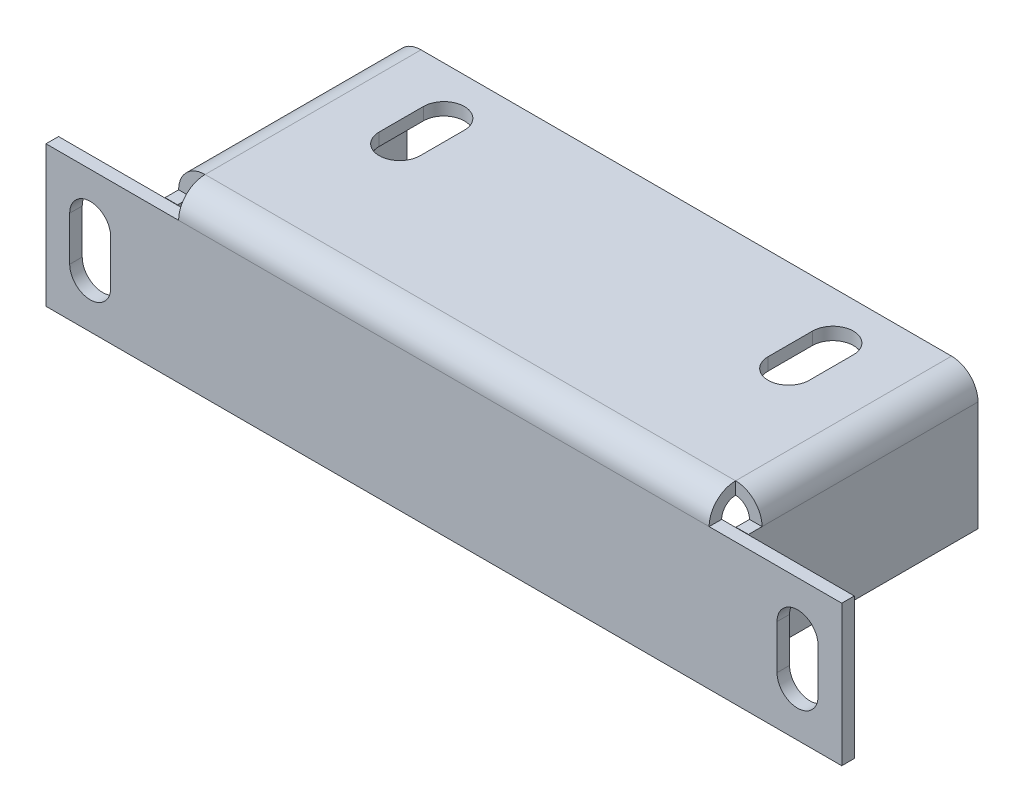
ISO-10303-21;
HEADER;
FILE_DESCRIPTION(('STEP AP214'),'2;1');
FILE_NAME('part.step','',(''),(''),'','','');
FILE_SCHEMA(('AUTOMOTIVE_DESIGN { 1 0 10303 214 1 1 1 1 }'));
ENDSEC;
DATA;
#1=APPLICATION_CONTEXT('core data for automotive mechanical design processes');
#2=APPLICATION_PROTOCOL_DEFINITION('international standard','automotive_design',2000,#1);
#3=PRODUCT_CONTEXT('',#1,'mechanical');
#4=PRODUCT('Part','Part','',(#3));
#5=PRODUCT_RELATED_PRODUCT_CATEGORY('part','',(#4));
#6=PRODUCT_DEFINITION_FORMATION('','',#4);
#7=PRODUCT_DEFINITION_CONTEXT('part definition',#1,'design');
#8=PRODUCT_DEFINITION('design','',#6,#7);
#9=PRODUCT_DEFINITION_SHAPE('','',#8);
#10=(LENGTH_UNIT() NAMED_UNIT(*) SI_UNIT(.MILLI.,.METRE.));
#11=(NAMED_UNIT(*) PLANE_ANGLE_UNIT() SI_UNIT($,.RADIAN.));
#12=(NAMED_UNIT(*) SI_UNIT($,.STERADIAN.) SOLID_ANGLE_UNIT());
#13=UNCERTAINTY_MEASURE_WITH_UNIT(LENGTH_MEASURE(1.E-05),#10,'distance_accuracy_value','');
#14=(GEOMETRIC_REPRESENTATION_CONTEXT(3) GLOBAL_UNCERTAINTY_ASSIGNED_CONTEXT((#13)) GLOBAL_UNIT_ASSIGNED_CONTEXT((#10,
#11,#12)) REPRESENTATION_CONTEXT('',''));
#15=CARTESIAN_POINT('',(0.,0.,0.));
#16=DIRECTION('',(0.,0.,1.));
#17=DIRECTION('',(1.,0.,0.));
#18=AXIS2_PLACEMENT_3D('',#15,#16,#17);
#19=CARTESIAN_POINT('',(0.,0.899999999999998,0.));
#20=DIRECTION('',(0.,-1.,0.));
#21=DIRECTION('',(0.,0.,-1.));
#22=AXIS2_PLACEMENT_3D('',#19,#20,#21);
#23=PLANE('',#22);
#24=DIRECTION('',(0.,0.,-1.));
#25=VECTOR('',#24,1.);
#26=CARTESIAN_POINT('',(31.5468,0.900000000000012,-13.07));
#27=LINE('',#26,#25);
#28=CARTESIAN_POINT('',(31.5468,0.900000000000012,-9.89499999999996));
#29=VERTEX_POINT('',#28);
#30=CARTESIAN_POINT('',(31.5468,0.900000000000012,-13.07));
#31=VERTEX_POINT('',#30);
#32=EDGE_CURVE('E524',#29,#31,#27,.T.);
#33=ORIENTED_EDGE('',*,*,#32,.T.);
#34=CARTESIAN_POINT('',(33.02,0.900000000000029,-13.07));
#35=DIRECTION('',(0.,-1.,0.));
#36=DIRECTION('',(0.,0.,1.));
#37=AXIS2_PLACEMENT_3D('',#34,#35,#36);
#38=CIRCLE('',#37,1.4732);
#39=CARTESIAN_POINT('',(34.4932,0.900000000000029,-13.07));
#40=VERTEX_POINT('',#39);
#41=EDGE_CURVE('E514',#31,#40,#38,.T.);
#42=ORIENTED_EDGE('',*,*,#41,.T.);
#43=DIRECTION('',(0.,0.,1.));
#44=VECTOR('',#43,1.);
#45=CARTESIAN_POINT('',(34.4932,0.900000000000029,-9.89499999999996));
#46=LINE('',#45,#44);
#47=CARTESIAN_POINT('',(34.4932,0.900000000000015,-9.89499999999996));
#48=VERTEX_POINT('',#47);
#49=EDGE_CURVE('E517',#40,#48,#46,.T.);
#50=ORIENTED_EDGE('',*,*,#49,.T.);
#51=CARTESIAN_POINT('',(33.02,0.900000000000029,-9.89499999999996));
#52=DIRECTION('',(0.,-1.,0.));
#53=DIRECTION('',(0.,0.,1.));
#54=AXIS2_PLACEMENT_3D('',#51,#52,#53);
#55=CIRCLE('',#54,1.4732);
#56=EDGE_CURVE('E521',#48,#29,#55,.T.);
#57=ORIENTED_EDGE('',*,*,#56,.T.);
#58=EDGE_LOOP('',(#33,#42,#50,#57));
#59=FACE_BOUND('',#58,.T.);
#60=DIRECTION('',(0.,0.,1.));
#61=VECTOR('',#60,1.);
#62=CARTESIAN_POINT('',(6.5532,0.900000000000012,-13.07));
#63=LINE('',#62,#61);
#64=CARTESIAN_POINT('',(6.5532,0.900000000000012,-13.07));
#65=VERTEX_POINT('',#64);
#66=CARTESIAN_POINT('',(6.5532,0.900000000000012,-9.89499999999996));
#67=VERTEX_POINT('',#66);
#68=EDGE_CURVE('E556',#65,#67,#63,.T.);
#69=ORIENTED_EDGE('',*,*,#68,.T.);
#70=CARTESIAN_POINT('',(5.08,0.900000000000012,-9.89499999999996));
#71=DIRECTION('',(0.,-1.,0.));
#72=DIRECTION('',(0.,0.,-1.));
#73=AXIS2_PLACEMENT_3D('',#70,#71,#72);
#74=CIRCLE('',#73,1.4732);
#75=CARTESIAN_POINT('',(3.6068,0.900000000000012,-9.89499999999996));
#76=VERTEX_POINT('',#75);
#77=EDGE_CURVE('E546',#67,#76,#74,.T.);
#78=ORIENTED_EDGE('',*,*,#77,.T.);
#79=DIRECTION('',(0.,0.,-1.));
#80=VECTOR('',#79,1.);
#81=CARTESIAN_POINT('',(3.6068,0.900000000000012,-9.89499999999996));
#82=LINE('',#81,#80);
#83=CARTESIAN_POINT('',(3.60680000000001,0.899999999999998,-13.07));
#84=VERTEX_POINT('',#83);
#85=EDGE_CURVE('E549',#76,#84,#82,.T.);
#86=ORIENTED_EDGE('',*,*,#85,.T.);
#87=CARTESIAN_POINT('',(5.08,0.900000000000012,-13.07));
#88=DIRECTION('',(0.,-1.,0.));
#89=DIRECTION('',(0.,0.,-1.));
#90=AXIS2_PLACEMENT_3D('',#87,#88,#89);
#91=CIRCLE('',#90,1.4732);
#92=EDGE_CURVE('E553',#84,#65,#91,.T.);
#93=ORIENTED_EDGE('',*,*,#92,.T.);
#94=EDGE_LOOP('',(#69,#78,#86,#93));
#95=FACE_BOUND('',#94,.T.);
#96=DIRECTION('',(-1.,0.,0.));
#97=VECTOR('',#96,1.);
#98=CARTESIAN_POINT('',(0.,0.900000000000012,-1.));
#99=LINE('',#98,#97);
#100=CARTESIAN_POINT('',(0.,0.900000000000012,-1.));
#101=VERTEX_POINT('',#100);
#102=CARTESIAN_POINT('',(38.1,0.900000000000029,-1.));
#103=VERTEX_POINT('',#102);
#104=EDGE_CURVE('E593',#101,#103,#99,.F.);
#105=ORIENTED_EDGE('',*,*,#104,.T.);
#106=DIRECTION('',(0.,0.,-1.));
#107=VECTOR('',#106,1.);
#108=CARTESIAN_POINT('',(38.1,0.900000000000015,0.));
#109=LINE('',#108,#107);
#110=CARTESIAN_POINT('',(38.1,0.900000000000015,-16.51));
#111=VERTEX_POINT('',#110);
#112=EDGE_CURVE('E620',#103,#111,#109,.T.);
#113=ORIENTED_EDGE('',*,*,#112,.T.);
#114=DIRECTION('',(-1.,0.,0.));
#115=VECTOR('',#114,1.);
#116=CARTESIAN_POINT('',(0.,0.899999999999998,-16.51));
#117=LINE('',#116,#115);
#118=CARTESIAN_POINT('',(0.,0.899999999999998,-16.51));
#119=VERTEX_POINT('',#118);
#120=EDGE_CURVE('E624',#111,#119,#117,.T.);
#121=ORIENTED_EDGE('',*,*,#120,.T.);
#122=DIRECTION('',(0.,0.,1.));
#123=VECTOR('',#122,1.);
#124=CARTESIAN_POINT('',(0.,0.899999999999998,0.));
#125=LINE('',#124,#123);
#126=EDGE_CURVE('E617',#119,#101,#125,.T.);
#127=ORIENTED_EDGE('',*,*,#126,.T.);
#128=EDGE_LOOP('',(#105,#113,#121,#127));
#129=FACE_BOUND('',#128,.T.);
#130=ADVANCED_FACE('F75',(#59,#95,#129),#23,.F.);
#131=CARTESIAN_POINT('',(0.,0.,0.));
#132=DIRECTION('',(0.,-1.,0.));
#133=DIRECTION('',(0.,0.,-1.));
#134=AXIS2_PLACEMENT_3D('',#131,#132,#133);
#135=PLANE('',#134);
#136=CARTESIAN_POINT('',(33.02,0.,-13.07));
#137=DIRECTION('',(0.,-1.,0.));
#138=DIRECTION('',(0.,0.,1.));
#139=AXIS2_PLACEMENT_3D('',#136,#137,#138);
#140=CIRCLE('',#139,1.4732);
#141=CARTESIAN_POINT('',(31.5468,0.,-13.07));
#142=VERTEX_POINT('',#141);
#143=CARTESIAN_POINT('',(34.4932,0.,-13.07));
#144=VERTEX_POINT('',#143);
#145=EDGE_CURVE('E513',#142,#144,#140,.T.);
#146=ORIENTED_EDGE('',*,*,#145,.F.);
#147=DIRECTION('',(0.,0.,-1.));
#148=VECTOR('',#147,1.);
#149=CARTESIAN_POINT('',(31.5468,0.,-13.07));
#150=LINE('',#149,#148);
#151=CARTESIAN_POINT('',(31.5468,0.,-9.89499999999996));
#152=VERTEX_POINT('',#151);
#153=EDGE_CURVE('E518',#152,#142,#150,.T.);
#154=ORIENTED_EDGE('',*,*,#153,.F.);
#155=CARTESIAN_POINT('',(33.02,0.,-9.89499999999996));
#156=DIRECTION('',(0.,-1.,0.));
#157=DIRECTION('',(0.,0.,1.));
#158=AXIS2_PLACEMENT_3D('',#155,#156,#157);
#159=CIRCLE('',#158,1.4732);
#160=CARTESIAN_POINT('',(34.4932,0.,-9.89499999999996));
#161=VERTEX_POINT('',#160);
#162=EDGE_CURVE('E532',#161,#152,#159,.T.);
#163=ORIENTED_EDGE('',*,*,#162,.F.);
#164=DIRECTION('',(0.,0.,1.));
#165=VECTOR('',#164,1.);
#166=CARTESIAN_POINT('',(34.4932,0.,-9.89499999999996));
#167=LINE('',#166,#165);
#168=EDGE_CURVE('E529',#144,#161,#167,.T.);
#169=ORIENTED_EDGE('',*,*,#168,.F.);
#170=EDGE_LOOP('',(#146,#154,#163,#169));
#171=FACE_BOUND('',#170,.T.);
#172=CARTESIAN_POINT('',(5.08,0.,-9.89499999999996));
#173=DIRECTION('',(0.,-1.,0.));
#174=DIRECTION('',(0.,0.,-1.));
#175=AXIS2_PLACEMENT_3D('',#172,#173,#174);
#176=CIRCLE('',#175,1.4732);
#177=CARTESIAN_POINT('',(6.5532,0.,-9.89499999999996));
#178=VERTEX_POINT('',#177);
#179=CARTESIAN_POINT('',(3.6068,0.,-9.89499999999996));
#180=VERTEX_POINT('',#179);
#181=EDGE_CURVE('E539',#178,#180,#176,.T.);
#182=ORIENTED_EDGE('',*,*,#181,.F.);
#183=DIRECTION('',(0.,0.,1.));
#184=VECTOR('',#183,1.);
#185=CARTESIAN_POINT('',(6.5532,0.,-13.07));
#186=LINE('',#185,#184);
#187=CARTESIAN_POINT('',(6.5532,0.,-13.07));
#188=VERTEX_POINT('',#187);
#189=EDGE_CURVE('E550',#188,#178,#186,.T.);
#190=ORIENTED_EDGE('',*,*,#189,.F.);
#191=CARTESIAN_POINT('',(5.08,0.,-13.07));
#192=DIRECTION('',(0.,-1.,0.));
#193=DIRECTION('',(0.,0.,-1.));
#194=AXIS2_PLACEMENT_3D('',#191,#192,#193);
#195=CIRCLE('',#194,1.4732);
#196=CARTESIAN_POINT('',(3.60680000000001,0.,-13.07));
#197=VERTEX_POINT('',#196);
#198=EDGE_CURVE('E564',#197,#188,#195,.T.);
#199=ORIENTED_EDGE('',*,*,#198,.F.);
#200=DIRECTION('',(0.,0.,-1.));
#201=VECTOR('',#200,1.);
#202=CARTESIAN_POINT('',(3.6068,0.,-9.89499999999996));
#203=LINE('',#202,#201);
#204=EDGE_CURVE('E561',#180,#197,#203,.T.);
#205=ORIENTED_EDGE('',*,*,#204,.F.);
#206=EDGE_LOOP('',(#182,#190,#199,#205));
#207=FACE_BOUND('',#206,.T.);
#208=DIRECTION('',(0.,0.,-1.));
#209=VECTOR('',#208,1.);
#210=CARTESIAN_POINT('',(38.1,0.,0.));
#211=LINE('',#210,#209);
#212=CARTESIAN_POINT('',(38.1,0.,-1.));
#213=VERTEX_POINT('',#212);
#214=CARTESIAN_POINT('',(38.1,0.,-16.51));
#215=VERTEX_POINT('',#214);
#216=EDGE_CURVE('E628',#213,#215,#211,.T.);
#217=ORIENTED_EDGE('',*,*,#216,.F.);
#218=DIRECTION('',(-1.,0.,0.));
#219=VECTOR('',#218,1.);
#220=CARTESIAN_POINT('',(0.,0.,-1.));
#221=LINE('',#220,#219);
#222=CARTESIAN_POINT('',(0.,0.,-1.));
#223=VERTEX_POINT('',#222);
#224=EDGE_CURVE('E606',#223,#213,#221,.F.);
#225=ORIENTED_EDGE('',*,*,#224,.F.);
#226=DIRECTION('',(0.,0.,1.));
#227=VECTOR('',#226,1.);
#228=CARTESIAN_POINT('',(0.,0.,0.));
#229=LINE('',#228,#227);
#230=CARTESIAN_POINT('',(0.,0.,-16.51));
#231=VERTEX_POINT('',#230);
#232=EDGE_CURVE('E614',#231,#223,#229,.T.);
#233=ORIENTED_EDGE('',*,*,#232,.F.);
#234=DIRECTION('',(-1.,0.,0.));
#235=VECTOR('',#234,1.);
#236=CARTESIAN_POINT('',(0.,0.,-16.51));
#237=LINE('',#236,#235);
#238=EDGE_CURVE('E621',#215,#231,#237,.T.);
#239=ORIENTED_EDGE('',*,*,#238,.F.);
#240=EDGE_LOOP('',(#217,#225,#233,#239));
#241=FACE_BOUND('',#240,.T.);
#242=ADVANCED_FACE('F647',(#171,#207,#241),#135,.T.);
#243=CARTESIAN_POINT('',(0.,0.899999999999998,-16.51));
#244=DIRECTION('',(0.,0.,1.));
#245=DIRECTION('',(1.,0.,0.));
#246=AXIS2_PLACEMENT_3D('',#243,#244,#245);
#247=PLANE('',#246);
#248=ORIENTED_EDGE('',*,*,#238,.T.);
#249=DIRECTION('',(0.,-1.,0.));
#250=VECTOR('',#249,1.);
#251=CARTESIAN_POINT('',(0.,0.899999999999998,-16.51));
#252=LINE('',#251,#250);
#253=EDGE_CURVE('E83',#119,#231,#252,.T.);
#254=ORIENTED_EDGE('',*,*,#253,.F.);
#255=ORIENTED_EDGE('',*,*,#120,.F.);
#256=DIRECTION('',(0.,-1.,0.));
#257=VECTOR('',#256,1.);
#258=CARTESIAN_POINT('',(38.1,0.900000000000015,-16.51));
#259=LINE('',#258,#257);
#260=EDGE_CURVE('E15',#111,#215,#259,.T.);
#261=ORIENTED_EDGE('',*,*,#260,.T.);
#262=EDGE_LOOP('',(#248,#254,#255,#261));
#263=FACE_BOUND('',#262,.T.);
#264=ADVANCED_FACE('F77',(#263),#247,.F.);
#265=CARTESIAN_POINT('',(38.1,-0.999999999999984,-1.));
#266=DIRECTION('',(1.,0.,0.));
#267=DIRECTION('',(0.,0.,-1.));
#268=AXIS2_PLACEMENT_3D('',#265,#266,#267);
#269=PLANE('',#268);
#270=DIRECTION('',(0.,0.,1.));
#271=VECTOR('',#270,1.);
#272=CARTESIAN_POINT('',(38.1,-0.999999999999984,0.));
#273=LINE('',#272,#271);
#274=CARTESIAN_POINT('',(38.1,-0.99999999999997,0.));
#275=VERTEX_POINT('',#274);
#276=CARTESIAN_POINT('',(38.1,-0.99999999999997,0.900000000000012));
#277=VERTEX_POINT('',#276);
#278=EDGE_CURVE('E571',#275,#277,#273,.T.);
#279=ORIENTED_EDGE('',*,*,#278,.F.);
#280=CARTESIAN_POINT('',(38.1,-0.999999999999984,-1.));
#281=DIRECTION('',(-1.,0.,0.));
#282=DIRECTION('',(0.,0.,1.));
#283=AXIS2_PLACEMENT_3D('',#280,#281,#282);
#284=CIRCLE('',#283,1.);
#285=EDGE_CURVE('E603',#213,#275,#284,.F.);
#286=ORIENTED_EDGE('',*,*,#285,.F.);
#287=DIRECTION('',(0.,1.,0.));
#288=VECTOR('',#287,1.);
#289=CARTESIAN_POINT('',(38.1,0.,-1.));
#290=LINE('',#289,#288);
#291=EDGE_CURVE('E611',#213,#103,#290,.T.);
#292=ORIENTED_EDGE('',*,*,#291,.T.);
#293=CARTESIAN_POINT('',(38.1,-0.999999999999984,-1.));
#294=DIRECTION('',(-1.,0.,0.));
#295=DIRECTION('',(0.,0.,1.));
#296=AXIS2_PLACEMENT_3D('',#293,#294,#295);
#297=CIRCLE('',#296,1.9);
#298=EDGE_CURVE('E596',#103,#277,#297,.F.);
#299=ORIENTED_EDGE('',*,*,#298,.T.);
#300=EDGE_LOOP('',(#279,#286,#292,#299));
#301=FACE_BOUND('',#300,.T.);
#302=ADVANCED_FACE('F690',(#301),#269,.T.);
#303=CARTESIAN_POINT('',(0.,-1.,-1.));
#304=DIRECTION('',(1.,0.,0.));
#305=DIRECTION('',(0.,0.,-1.));
#306=AXIS2_PLACEMENT_3D('',#303,#304,#305);
#307=PLANE('',#306);
#308=CARTESIAN_POINT('',(0.,-1.,-1.));
#309=DIRECTION('',(-1.,0.,0.));
#310=DIRECTION('',(0.,0.,1.));
#311=AXIS2_PLACEMENT_3D('',#308,#309,#310);
#312=CIRCLE('',#311,1.);
#313=CARTESIAN_POINT('',(0.,-1.,0.));
#314=VERTEX_POINT('',#313);
#315=EDGE_CURVE('E591',#314,#223,#312,.T.);
#316=ORIENTED_EDGE('',*,*,#315,.F.);
#317=DIRECTION('',(0.,0.,1.));
#318=VECTOR('',#317,1.);
#319=CARTESIAN_POINT('',(0.,-1.,0.));
#320=LINE('',#319,#318);
#321=CARTESIAN_POINT('',(0.,-1.,0.90000000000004));
#322=VERTEX_POINT('',#321);
#323=EDGE_CURVE('E581',#314,#322,#320,.T.);
#324=ORIENTED_EDGE('',*,*,#323,.T.);
#325=CARTESIAN_POINT('',(0.,-1.,-1.));
#326=DIRECTION('',(-1.,0.,0.));
#327=DIRECTION('',(0.,0.,1.));
#328=AXIS2_PLACEMENT_3D('',#325,#326,#327);
#329=CIRCLE('',#328,1.9);
#330=EDGE_CURVE('E597',#322,#101,#329,.T.);
#331=ORIENTED_EDGE('',*,*,#330,.T.);
#332=DIRECTION('',(0.,1.,0.));
#333=VECTOR('',#332,1.);
#334=CARTESIAN_POINT('',(0.,0.,-1.));
#335=LINE('',#334,#333);
#336=EDGE_CURVE('E600',#223,#101,#335,.T.);
#337=ORIENTED_EDGE('',*,*,#336,.F.);
#338=EDGE_LOOP('',(#316,#324,#331,#337));
#339=FACE_BOUND('',#338,.T.);
#340=ADVANCED_FACE('F653',(#339),#307,.F.);
#341=CARTESIAN_POINT('',(0.,-1.,-1.));
#342=DIRECTION('',(-1.,0.,0.));
#343=DIRECTION('',(0.,0.,1.));
#344=AXIS2_PLACEMENT_3D('',#341,#342,#343);
#345=CYLINDRICAL_SURFACE('',#344,1.9);
#346=ORIENTED_EDGE('',*,*,#104,.F.);
#347=ORIENTED_EDGE('',*,*,#330,.F.);
#348=DIRECTION('',(1.,0.,0.));
#349=VECTOR('',#348,1.);
#350=CARTESIAN_POINT('',(0.,-1.,0.900000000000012));
#351=LINE('',#350,#349);
#352=EDGE_CURVE('E584',#322,#277,#351,.T.);
#353=ORIENTED_EDGE('',*,*,#352,.T.);
#354=ORIENTED_EDGE('',*,*,#298,.F.);
#355=EDGE_LOOP('',(#346,#347,#353,#354));
#356=FACE_BOUND('',#355,.T.);
#357=ADVANCED_FACE('F688',(#356),#345,.T.);
#358=CARTESIAN_POINT('',(0.,-1.,-1.));
#359=DIRECTION('',(-1.,0.,0.));
#360=DIRECTION('',(0.,0.,1.));
#361=AXIS2_PLACEMENT_3D('',#358,#359,#360);
#362=CYLINDRICAL_SURFACE('',#361,1.);
#363=ORIENTED_EDGE('',*,*,#224,.T.);
#364=ORIENTED_EDGE('',*,*,#285,.T.);
#365=DIRECTION('',(-1.,0.,0.));
#366=VECTOR('',#365,1.);
#367=CARTESIAN_POINT('',(38.1,-0.999999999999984,0.));
#368=LINE('',#367,#366);
#369=EDGE_CURVE('E578',#275,#314,#368,.T.);
#370=ORIENTED_EDGE('',*,*,#369,.T.);
#371=ORIENTED_EDGE('',*,*,#315,.T.);
#372=EDGE_LOOP('',(#363,#364,#370,#371));
#373=FACE_BOUND('',#372,.T.);
#374=ADVANCED_FACE('F656',(#373),#362,.F.);
#375=CARTESIAN_POINT('',(0.,0.,0.900000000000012));
#376=DIRECTION('',(0.,0.,-1.));
#377=DIRECTION('',(0.,1.,0.));
#378=AXIS2_PLACEMENT_3D('',#375,#376,#377);
#379=PLANE('',#378);
#380=DIRECTION('',(0.,-1.,0.));
#381=VECTOR('',#380,1.);
#382=CARTESIAN_POINT('',(-4.8768,-7.64374999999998,0.900000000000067));
#383=LINE('',#382,#381);
#384=CARTESIAN_POINT('',(-4.8768,-4.46874999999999,0.900000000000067));
#385=VERTEX_POINT('',#384);
#386=CARTESIAN_POINT('',(-4.8768,-7.64374999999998,0.900000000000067));
#387=VERTEX_POINT('',#386);
#388=EDGE_CURVE('E430',#385,#387,#383,.T.);
#389=ORIENTED_EDGE('',*,*,#388,.T.);
#390=CARTESIAN_POINT('',(-6.35,-7.64375,0.900000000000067));
#391=DIRECTION('',(0.,0.,-1.));
#392=DIRECTION('',(0.,-1.,0.));
#393=AXIS2_PLACEMENT_3D('',#390,#391,#392);
#394=CIRCLE('',#393,1.4732);
#395=CARTESIAN_POINT('',(-7.8232,-7.64374999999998,0.900000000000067));
#396=VERTEX_POINT('',#395);
#397=EDGE_CURVE('E422',#387,#396,#394,.T.);
#398=ORIENTED_EDGE('',*,*,#397,.T.);
#399=DIRECTION('',(0.,1.,0.));
#400=VECTOR('',#399,1.);
#401=CARTESIAN_POINT('',(-7.8232,-4.46874999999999,0.900000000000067));
#402=LINE('',#401,#400);
#403=CARTESIAN_POINT('',(-7.8232,-4.46874999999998,0.900000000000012));
#404=VERTEX_POINT('',#403);
#405=EDGE_CURVE('E425',#396,#404,#402,.T.);
#406=ORIENTED_EDGE('',*,*,#405,.T.);
#407=CARTESIAN_POINT('',(-6.35,-4.46874999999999,0.900000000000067));
#408=DIRECTION('',(0.,0.,-1.));
#409=DIRECTION('',(0.,-1.,0.));
#410=AXIS2_PLACEMENT_3D('',#407,#408,#409);
#411=CIRCLE('',#410,1.4732);
#412=EDGE_CURVE('E90',#404,#385,#411,.T.);
#413=ORIENTED_EDGE('',*,*,#412,.T.);
#414=EDGE_LOOP('',(#389,#398,#406,#413));
#415=FACE_BOUND('',#414,.T.);
#416=DIRECTION('',(0.,1.,0.));
#417=VECTOR('',#416,1.);
#418=CARTESIAN_POINT('',(42.9768,-7.64374999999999,0.900000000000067));
#419=LINE('',#418,#417);
#420=CARTESIAN_POINT('',(42.9768,-7.64374999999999,0.900000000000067));
#421=VERTEX_POINT('',#420);
#422=CARTESIAN_POINT('',(42.9768,-4.46874999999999,0.900000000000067));
#423=VERTEX_POINT('',#422);
#424=EDGE_CURVE('E461',#421,#423,#419,.T.);
#425=ORIENTED_EDGE('',*,*,#424,.T.);
#426=CARTESIAN_POINT('',(44.45,-4.46875000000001,0.900000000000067));
#427=DIRECTION('',(0.,0.,-1.));
#428=DIRECTION('',(0.,1.,0.));
#429=AXIS2_PLACEMENT_3D('',#426,#427,#428);
#430=CIRCLE('',#429,1.4732);
#431=CARTESIAN_POINT('',(45.9232,-4.46874999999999,0.900000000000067));
#432=VERTEX_POINT('',#431);
#433=EDGE_CURVE('E451',#423,#432,#430,.T.);
#434=ORIENTED_EDGE('',*,*,#433,.T.);
#435=DIRECTION('',(0.,-1.,0.));
#436=VECTOR('',#435,1.);
#437=CARTESIAN_POINT('',(45.9232,-4.46874999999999,0.900000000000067));
#438=LINE('',#437,#436);
#439=CARTESIAN_POINT('',(45.9232,-7.64374999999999,0.90000000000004));
#440=VERTEX_POINT('',#439);
#441=EDGE_CURVE('E454',#432,#440,#438,.T.);
#442=ORIENTED_EDGE('',*,*,#441,.T.);
#443=CARTESIAN_POINT('',(44.45,-7.64375,0.900000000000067));
#444=DIRECTION('',(0.,0.,-1.));
#445=DIRECTION('',(0.,1.,0.));
#446=AXIS2_PLACEMENT_3D('',#443,#444,#445);
#447=CIRCLE('',#446,1.4732);
#448=EDGE_CURVE('E458',#440,#421,#447,.T.);
#449=ORIENTED_EDGE('',*,*,#448,.T.);
#450=EDGE_LOOP('',(#425,#434,#442,#449));
#451=FACE_BOUND('',#450,.T.);
#452=ORIENTED_EDGE('',*,*,#352,.F.);
#453=DIRECTION('',(1.,0.,0.));
#454=VECTOR('',#453,1.);
#455=CARTESIAN_POINT('',(-9.52500000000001,-1.,0.90000000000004));
#456=LINE('',#455,#454);
#457=CARTESIAN_POINT('',(-9.52500000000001,-1.,0.90000000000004));
#458=VERTEX_POINT('',#457);
#459=EDGE_CURVE('E495',#458,#322,#456,.T.);
#460=ORIENTED_EDGE('',*,*,#459,.F.);
#461=DIRECTION('',(0.,1.,0.));
#462=VECTOR('',#461,1.);
#463=CARTESIAN_POINT('',(-9.52500000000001,-1.,0.90000000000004));
#464=LINE('',#463,#462);
#465=CARTESIAN_POINT('',(-9.52500000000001,-11.1125,0.90000000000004));
#466=VERTEX_POINT('',#465);
#467=EDGE_CURVE('E488',#466,#458,#464,.T.);
#468=ORIENTED_EDGE('',*,*,#467,.F.);
#469=DIRECTION('',(1.,0.,0.));
#470=VECTOR('',#469,1.);
#471=CARTESIAN_POINT('',(38.1,-11.1125,0.90000000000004));
#472=LINE('',#471,#470);
#473=CARTESIAN_POINT('',(47.625,-11.1125,0.900000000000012));
#474=VERTEX_POINT('',#473);
#475=EDGE_CURVE('E589',#466,#474,#472,.T.);
#476=ORIENTED_EDGE('',*,*,#475,.T.);
#477=DIRECTION('',(0.,-1.,0.));
#478=VECTOR('',#477,1.);
#479=CARTESIAN_POINT('',(47.625,-1.00000000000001,0.900000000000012));
#480=LINE('',#479,#478);
#481=CARTESIAN_POINT('',(47.625,-1.00000000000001,0.900000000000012));
#482=VERTEX_POINT('',#481);
#483=EDGE_CURVE('E497',#482,#474,#480,.T.);
#484=ORIENTED_EDGE('',*,*,#483,.F.);
#485=DIRECTION('',(-1.,0.,0.));
#486=VECTOR('',#485,1.);
#487=CARTESIAN_POINT('',(47.625,-1.00000000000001,0.900000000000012));
#488=LINE('',#487,#486);
#489=EDGE_CURVE('E507',#482,#277,#488,.T.);
#490=ORIENTED_EDGE('',*,*,#489,.T.);
#491=EDGE_LOOP('',(#452,#460,#468,#476,#484,#490));
#492=FACE_BOUND('',#491,.T.);
#493=ADVANCED_FACE('F684',(#415,#451,#492),#379,.F.);
#494=CARTESIAN_POINT('',(0.,0.,0.));
#495=DIRECTION('',(0.,0.,-1.));
#496=DIRECTION('',(0.,1.,0.));
#497=AXIS2_PLACEMENT_3D('',#494,#495,#496);
#498=PLANE('',#497);
#499=CARTESIAN_POINT('',(-6.35,-7.64375,0.));
#500=DIRECTION('',(0.,0.,-1.));
#501=DIRECTION('',(0.,-1.,0.));
#502=AXIS2_PLACEMENT_3D('',#499,#500,#501);
#503=CIRCLE('',#502,1.4732);
#504=CARTESIAN_POINT('',(-4.8768,-7.64374999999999,0.));
#505=VERTEX_POINT('',#504);
#506=CARTESIAN_POINT('',(-7.8232,-7.64374999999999,0.));
#507=VERTEX_POINT('',#506);
#508=EDGE_CURVE('E98',#505,#507,#503,.T.);
#509=ORIENTED_EDGE('',*,*,#508,.F.);
#510=DIRECTION('',(0.,-1.,0.));
#511=VECTOR('',#510,1.);
#512=CARTESIAN_POINT('',(-4.8768,-7.64374999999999,0.));
#513=LINE('',#512,#511);
#514=CARTESIAN_POINT('',(-4.8768,-4.46874999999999,0.));
#515=VERTEX_POINT('',#514);
#516=EDGE_CURVE('E426',#515,#505,#513,.T.);
#517=ORIENTED_EDGE('',*,*,#516,.F.);
#518=CARTESIAN_POINT('',(-6.35,-4.46874999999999,0.));
#519=DIRECTION('',(0.,0.,-1.));
#520=DIRECTION('',(0.,-1.,0.));
#521=AXIS2_PLACEMENT_3D('',#518,#519,#520);
#522=CIRCLE('',#521,1.4732);
#523=CARTESIAN_POINT('',(-7.8232,-4.46874999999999,0.));
#524=VERTEX_POINT('',#523);
#525=EDGE_CURVE('E438',#524,#515,#522,.T.);
#526=ORIENTED_EDGE('',*,*,#525,.F.);
#527=DIRECTION('',(0.,1.,0.));
#528=VECTOR('',#527,1.);
#529=CARTESIAN_POINT('',(-7.8232,-4.46874999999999,0.));
#530=LINE('',#529,#528);
#531=EDGE_CURVE('E435',#507,#524,#530,.T.);
#532=ORIENTED_EDGE('',*,*,#531,.F.);
#533=EDGE_LOOP('',(#509,#517,#526,#532));
#534=FACE_BOUND('',#533,.T.);
#535=CARTESIAN_POINT('',(44.45,-4.46875000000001,0.));
#536=DIRECTION('',(0.,0.,-1.));
#537=DIRECTION('',(0.,1.,0.));
#538=AXIS2_PLACEMENT_3D('',#535,#536,#537);
#539=CIRCLE('',#538,1.4732);
#540=CARTESIAN_POINT('',(42.9768,-4.46874999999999,0.));
#541=VERTEX_POINT('',#540);
#542=CARTESIAN_POINT('',(45.9232,-4.46874999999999,0.));
#543=VERTEX_POINT('',#542);
#544=EDGE_CURVE('E445',#541,#543,#539,.T.);
#545=ORIENTED_EDGE('',*,*,#544,.F.);
#546=DIRECTION('',(0.,1.,0.));
#547=VECTOR('',#546,1.);
#548=CARTESIAN_POINT('',(42.9768,-7.64374999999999,0.));
#549=LINE('',#548,#547);
#550=CARTESIAN_POINT('',(42.9768,-7.64374999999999,0.));
#551=VERTEX_POINT('',#550);
#552=EDGE_CURVE('E455',#551,#541,#549,.T.);
#553=ORIENTED_EDGE('',*,*,#552,.F.);
#554=CARTESIAN_POINT('',(44.45,-7.64375,0.));
#555=DIRECTION('',(0.,0.,-1.));
#556=DIRECTION('',(0.,1.,0.));
#557=AXIS2_PLACEMENT_3D('',#554,#555,#556);
#558=CIRCLE('',#557,1.4732);
#559=CARTESIAN_POINT('',(45.9232,-7.64374999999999,0.));
#560=VERTEX_POINT('',#559);
#561=EDGE_CURVE('E469',#560,#551,#558,.T.);
#562=ORIENTED_EDGE('',*,*,#561,.F.);
#563=DIRECTION('',(0.,-1.,0.));
#564=VECTOR('',#563,1.);
#565=CARTESIAN_POINT('',(45.9232,-4.46874999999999,0.));
#566=LINE('',#565,#564);
#567=EDGE_CURVE('E466',#543,#560,#566,.T.);
#568=ORIENTED_EDGE('',*,*,#567,.F.);
#569=EDGE_LOOP('',(#545,#553,#562,#568));
#570=FACE_BOUND('',#569,.T.);
#571=DIRECTION('',(1.,0.,0.));
#572=VECTOR('',#571,1.);
#573=CARTESIAN_POINT('',(38.1,-11.1125,0.));
#574=LINE('',#573,#572);
#575=CARTESIAN_POINT('',(-9.52500000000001,-11.1125,0.));
#576=VERTEX_POINT('',#575);
#577=CARTESIAN_POINT('',(47.625,-11.1125,0.));
#578=VERTEX_POINT('',#577);
#579=EDGE_CURVE('E588',#576,#578,#574,.T.);
#580=ORIENTED_EDGE('',*,*,#579,.F.);
#581=DIRECTION('',(0.,-1.,0.));
#582=VECTOR('',#581,1.);
#583=CARTESIAN_POINT('',(-9.52500000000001,-1.,0.));
#584=LINE('',#583,#582);
#585=CARTESIAN_POINT('',(-9.52500000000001,-1.,0.));
#586=VERTEX_POINT('',#585);
#587=EDGE_CURVE('E476',#586,#576,#584,.T.);
#588=ORIENTED_EDGE('',*,*,#587,.F.);
#589=DIRECTION('',(1.,0.,0.));
#590=VECTOR('',#589,1.);
#591=CARTESIAN_POINT('',(-9.52500000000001,-1.,0.));
#592=LINE('',#591,#590);
#593=EDGE_CURVE('E492',#586,#314,#592,.T.);
#594=ORIENTED_EDGE('',*,*,#593,.T.);
#595=ORIENTED_EDGE('',*,*,#369,.F.);
#596=DIRECTION('',(-1.,0.,0.));
#597=VECTOR('',#596,1.);
#598=CARTESIAN_POINT('',(47.625,-1.00000000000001,0.));
#599=LINE('',#598,#597);
#600=CARTESIAN_POINT('',(47.625,-1.00000000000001,0.));
#601=VERTEX_POINT('',#600);
#602=EDGE_CURVE('E510',#601,#275,#599,.T.);
#603=ORIENTED_EDGE('',*,*,#602,.F.);
#604=DIRECTION('',(0.,1.,0.));
#605=VECTOR('',#604,1.);
#606=CARTESIAN_POINT('',(47.625,-1.00000000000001,0.));
#607=LINE('',#606,#605);
#608=EDGE_CURVE('E503',#578,#601,#607,.T.);
#609=ORIENTED_EDGE('',*,*,#608,.F.);
#610=EDGE_LOOP('',(#580,#588,#594,#595,#603,#609));
#611=FACE_BOUND('',#610,.T.);
#612=ADVANCED_FACE('F660',(#534,#570,#611),#498,.T.);
#613=CARTESIAN_POINT('',(38.1,-11.1125,0.90000000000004));
#614=DIRECTION('',(0.,1.,0.));
#615=DIRECTION('',(0.,0.,1.));
#616=AXIS2_PLACEMENT_3D('',#613,#614,#615);
#617=PLANE('',#616);
#618=ORIENTED_EDGE('',*,*,#579,.T.);
#619=DIRECTION('',(0.,0.,-1.));
#620=VECTOR('',#619,1.);
#621=CARTESIAN_POINT('',(47.625,-11.1125,0.900000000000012));
#622=LINE('',#621,#620);
#623=EDGE_CURVE('E500',#474,#578,#622,.T.);
#624=ORIENTED_EDGE('',*,*,#623,.F.);
#625=ORIENTED_EDGE('',*,*,#475,.F.);
#626=DIRECTION('',(0.,0.,1.));
#627=VECTOR('',#626,1.);
#628=CARTESIAN_POINT('',(-9.52500000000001,-11.1125,0.));
#629=LINE('',#628,#627);
#630=EDGE_CURVE('E485',#576,#466,#629,.T.);
#631=ORIENTED_EDGE('',*,*,#630,.F.);
#632=EDGE_LOOP('',(#618,#624,#625,#631));
#633=FACE_BOUND('',#632,.T.);
#634=ADVANCED_FACE('F674',(#633),#617,.F.);
#635=CARTESIAN_POINT('',(5.08,0.900000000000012,-9.89499999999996));
#636=DIRECTION('',(0.,-1.,0.));
#637=DIRECTION('',(0.,0.,-1.));
#638=AXIS2_PLACEMENT_3D('',#635,#636,#637);
#639=CYLINDRICAL_SURFACE('',#638,1.4732);
#640=ORIENTED_EDGE('',*,*,#181,.T.);
#641=DIRECTION('',(0.,-1.,0.));
#642=VECTOR('',#641,1.);
#643=CARTESIAN_POINT('',(3.6068,0.900000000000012,-9.89499999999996));
#644=LINE('',#643,#642);
#645=EDGE_CURVE('E559',#76,#180,#644,.T.);
#646=ORIENTED_EDGE('',*,*,#645,.F.);
#647=ORIENTED_EDGE('',*,*,#77,.F.);
#648=DIRECTION('',(0.,-1.,0.));
#649=VECTOR('',#648,1.);
#650=CARTESIAN_POINT('',(6.5532,0.900000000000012,-9.89499999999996));
#651=LINE('',#650,#649);
#652=EDGE_CURVE('E569',#67,#178,#651,.T.);
#653=ORIENTED_EDGE('',*,*,#652,.T.);
#654=EDGE_LOOP('',(#640,#646,#647,#653));
#655=FACE_BOUND('',#654,.T.);
#656=ADVANCED_FACE('F767',(#655),#639,.F.);
#657=CARTESIAN_POINT('',(6.5532,0.900000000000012,-13.07));
#658=DIRECTION('',(1.,0.,0.));
#659=DIRECTION('',(0.,0.,-1.));
#660=AXIS2_PLACEMENT_3D('',#657,#658,#659);
#661=PLANE('',#660);
#662=ORIENTED_EDGE('',*,*,#189,.T.);
#663=ORIENTED_EDGE('',*,*,#652,.F.);
#664=ORIENTED_EDGE('',*,*,#68,.F.);
#665=DIRECTION('',(0.,-1.,0.));
#666=VECTOR('',#665,1.);
#667=CARTESIAN_POINT('',(6.5532,0.900000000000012,-13.07));
#668=LINE('',#667,#666);
#669=EDGE_CURVE('E572',#65,#188,#668,.T.);
#670=ORIENTED_EDGE('',*,*,#669,.T.);
#671=EDGE_LOOP('',(#662,#663,#664,#670));
#672=FACE_BOUND('',#671,.T.);
#673=ADVANCED_FACE('F776',(#672),#661,.F.);
#674=CARTESIAN_POINT('',(5.08,0.900000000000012,-13.07));
#675=DIRECTION('',(0.,-1.,0.));
#676=DIRECTION('',(0.,0.,-1.));
#677=AXIS2_PLACEMENT_3D('',#674,#675,#676);
#678=CYLINDRICAL_SURFACE('',#677,1.4732);
#679=ORIENTED_EDGE('',*,*,#198,.T.);
#680=ORIENTED_EDGE('',*,*,#669,.F.);
#681=ORIENTED_EDGE('',*,*,#92,.F.);
#682=DIRECTION('',(0.,-1.,0.));
#683=VECTOR('',#682,1.);
#684=CARTESIAN_POINT('',(3.60680000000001,0.900000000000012,-13.07));
#685=LINE('',#684,#683);
#686=EDGE_CURVE('E574',#84,#197,#685,.T.);
#687=ORIENTED_EDGE('',*,*,#686,.T.);
#688=EDGE_LOOP('',(#679,#680,#681,#687));
#689=FACE_BOUND('',#688,.T.);
#690=ADVANCED_FACE('F782',(#689),#678,.F.);
#691=CARTESIAN_POINT('',(3.6068,0.900000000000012,-9.89499999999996));
#692=DIRECTION('',(-1.,0.,0.));
#693=DIRECTION('',(0.,0.,1.));
#694=AXIS2_PLACEMENT_3D('',#691,#692,#693);
#695=PLANE('',#694);
#696=ORIENTED_EDGE('',*,*,#204,.T.);
#697=ORIENTED_EDGE('',*,*,#686,.F.);
#698=ORIENTED_EDGE('',*,*,#85,.F.);
#699=ORIENTED_EDGE('',*,*,#645,.T.);
#700=EDGE_LOOP('',(#696,#697,#698,#699));
#701=FACE_BOUND('',#700,.T.);
#702=ADVANCED_FACE('F778',(#701),#695,.F.);
#703=CARTESIAN_POINT('',(33.02,0.900000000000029,-13.07));
#704=DIRECTION('',(0.,-1.,0.));
#705=DIRECTION('',(0.,0.,-1.));
#706=AXIS2_PLACEMENT_3D('',#703,#704,#705);
#707=CYLINDRICAL_SURFACE('',#706,1.4732);
#708=ORIENTED_EDGE('',*,*,#145,.T.);
#709=DIRECTION('',(0.,-1.,0.));
#710=VECTOR('',#709,1.);
#711=CARTESIAN_POINT('',(34.4932,0.900000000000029,-13.07));
#712=LINE('',#711,#710);
#713=EDGE_CURVE('E527',#40,#144,#712,.T.);
#714=ORIENTED_EDGE('',*,*,#713,.F.);
#715=ORIENTED_EDGE('',*,*,#41,.F.);
#716=DIRECTION('',(0.,-1.,0.));
#717=VECTOR('',#716,1.);
#718=CARTESIAN_POINT('',(31.5468,0.900000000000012,-13.07));
#719=LINE('',#718,#717);
#720=EDGE_CURVE('E537',#31,#142,#719,.T.);
#721=ORIENTED_EDGE('',*,*,#720,.T.);
#722=EDGE_LOOP('',(#708,#714,#715,#721));
#723=FACE_BOUND('',#722,.T.);
#724=ADVANCED_FACE('F781',(#723),#707,.F.);
#725=CARTESIAN_POINT('',(31.5468,0.900000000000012,-13.07));
#726=DIRECTION('',(-1.,0.,0.));
#727=DIRECTION('',(0.,0.,1.));
#728=AXIS2_PLACEMENT_3D('',#725,#726,#727);
#729=PLANE('',#728);
#730=ORIENTED_EDGE('',*,*,#153,.T.);
#731=ORIENTED_EDGE('',*,*,#720,.F.);
#732=ORIENTED_EDGE('',*,*,#32,.F.);
#733=DIRECTION('',(0.,-1.,0.));
#734=VECTOR('',#733,1.);
#735=CARTESIAN_POINT('',(31.5468,0.900000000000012,-9.89499999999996));
#736=LINE('',#735,#734);
#737=EDGE_CURVE('E540',#29,#152,#736,.T.);
#738=ORIENTED_EDGE('',*,*,#737,.T.);
#739=EDGE_LOOP('',(#730,#731,#732,#738));
#740=FACE_BOUND('',#739,.T.);
#741=ADVANCED_FACE('F792',(#740),#729,.F.);
#742=CARTESIAN_POINT('',(33.02,0.900000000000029,-9.89499999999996));
#743=DIRECTION('',(0.,-1.,0.));
#744=DIRECTION('',(0.,0.,-1.));
#745=AXIS2_PLACEMENT_3D('',#742,#743,#744);
#746=CYLINDRICAL_SURFACE('',#745,1.4732);
#747=ORIENTED_EDGE('',*,*,#162,.T.);
#748=ORIENTED_EDGE('',*,*,#737,.F.);
#749=ORIENTED_EDGE('',*,*,#56,.F.);
#750=DIRECTION('',(0.,-1.,0.));
#751=VECTOR('',#750,1.);
#752=CARTESIAN_POINT('',(34.4932,0.900000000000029,-9.89499999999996));
#753=LINE('',#752,#751);
#754=EDGE_CURVE('E542',#48,#161,#753,.T.);
#755=ORIENTED_EDGE('',*,*,#754,.T.);
#756=EDGE_LOOP('',(#747,#748,#749,#755));
#757=FACE_BOUND('',#756,.T.);
#758=ADVANCED_FACE('F797',(#757),#746,.F.);
#759=CARTESIAN_POINT('',(34.4932,0.900000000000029,-9.89499999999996));
#760=DIRECTION('',(1.,0.,0.));
#761=DIRECTION('',(0.,0.,-1.));
#762=AXIS2_PLACEMENT_3D('',#759,#760,#761);
#763=PLANE('',#762);
#764=ORIENTED_EDGE('',*,*,#168,.T.);
#765=ORIENTED_EDGE('',*,*,#754,.F.);
#766=ORIENTED_EDGE('',*,*,#49,.F.);
#767=ORIENTED_EDGE('',*,*,#713,.T.);
#768=EDGE_LOOP('',(#764,#765,#766,#767));
#769=FACE_BOUND('',#768,.T.);
#770=ADVANCED_FACE('F794',(#769),#763,.F.);
#771=CARTESIAN_POINT('',(47.625,-1.00000000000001,0.900000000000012));
#772=DIRECTION('',(0.,-1.,0.));
#773=DIRECTION('',(0.,0.,-1.));
#774=AXIS2_PLACEMENT_3D('',#771,#772,#773);
#775=PLANE('',#774);
#776=ORIENTED_EDGE('',*,*,#278,.T.);
#777=ORIENTED_EDGE('',*,*,#489,.F.);
#778=DIRECTION('',(0.,0.,1.));
#779=VECTOR('',#778,1.);
#780=CARTESIAN_POINT('',(47.625,-1.00000000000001,0.900000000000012));
#781=LINE('',#780,#779);
#782=EDGE_CURVE('E505',#601,#482,#781,.T.);
#783=ORIENTED_EDGE('',*,*,#782,.F.);
#784=ORIENTED_EDGE('',*,*,#602,.T.);
#785=EDGE_LOOP('',(#776,#777,#783,#784));
#786=FACE_BOUND('',#785,.T.);
#787=ADVANCED_FACE('F666',(#786),#775,.F.);
#788=CARTESIAN_POINT('',(47.625,-11.1125,0.900000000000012));
#789=DIRECTION('',(1.,0.,0.));
#790=DIRECTION('',(0.,0.,-1.));
#791=AXIS2_PLACEMENT_3D('',#788,#789,#790);
#792=PLANE('',#791);
#793=ORIENTED_EDGE('',*,*,#483,.T.);
#794=ORIENTED_EDGE('',*,*,#623,.T.);
#795=ORIENTED_EDGE('',*,*,#608,.T.);
#796=ORIENTED_EDGE('',*,*,#782,.T.);
#797=EDGE_LOOP('',(#793,#794,#795,#796));
#798=FACE_BOUND('',#797,.T.);
#799=ADVANCED_FACE('F670',(#798),#792,.T.);
#800=CARTESIAN_POINT('',(-9.52500000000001,-1.,0.));
#801=DIRECTION('',(0.,-1.,0.));
#802=DIRECTION('',(0.,0.,-1.));
#803=AXIS2_PLACEMENT_3D('',#800,#801,#802);
#804=PLANE('',#803);
#805=ORIENTED_EDGE('',*,*,#323,.F.);
#806=ORIENTED_EDGE('',*,*,#593,.F.);
#807=DIRECTION('',(0.,0.,-1.));
#808=VECTOR('',#807,1.);
#809=CARTESIAN_POINT('',(-9.52500000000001,-1.,0.));
#810=LINE('',#809,#808);
#811=EDGE_CURVE('E490',#458,#586,#810,.T.);
#812=ORIENTED_EDGE('',*,*,#811,.F.);
#813=ORIENTED_EDGE('',*,*,#459,.T.);
#814=EDGE_LOOP('',(#805,#806,#812,#813));
#815=FACE_BOUND('',#814,.T.);
#816=ADVANCED_FACE('F681',(#815),#804,.F.);
#817=CARTESIAN_POINT('',(-9.52500000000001,-11.1125,0.));
#818=DIRECTION('',(-1.,0.,0.));
#819=DIRECTION('',(0.,0.,1.));
#820=AXIS2_PLACEMENT_3D('',#817,#818,#819);
#821=PLANE('',#820);
#822=ORIENTED_EDGE('',*,*,#587,.T.);
#823=ORIENTED_EDGE('',*,*,#630,.T.);
#824=ORIENTED_EDGE('',*,*,#467,.T.);
#825=ORIENTED_EDGE('',*,*,#811,.T.);
#826=EDGE_LOOP('',(#822,#823,#824,#825));
#827=FACE_BOUND('',#826,.T.);
#828=ADVANCED_FACE('F677',(#827),#821,.T.);
#829=CARTESIAN_POINT('',(44.45,-4.46875000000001,0.900000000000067));
#830=DIRECTION('',(0.,0.,-1.));
#831=DIRECTION('',(0.,1.,0.));
#832=AXIS2_PLACEMENT_3D('',#829,#830,#831);
#833=CYLINDRICAL_SURFACE('',#832,1.4732);
#834=ORIENTED_EDGE('',*,*,#544,.T.);
#835=DIRECTION('',(0.,0.,-1.));
#836=VECTOR('',#835,1.);
#837=CARTESIAN_POINT('',(45.9232,-4.46874999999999,0.900000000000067));
#838=LINE('',#837,#836);
#839=EDGE_CURVE('E464',#432,#543,#838,.T.);
#840=ORIENTED_EDGE('',*,*,#839,.F.);
#841=ORIENTED_EDGE('',*,*,#433,.F.);
#842=DIRECTION('',(0.,0.,-1.));
#843=VECTOR('',#842,1.);
#844=CARTESIAN_POINT('',(42.9768,-4.46874999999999,0.900000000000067));
#845=LINE('',#844,#843);
#846=EDGE_CURVE('E474',#423,#541,#845,.T.);
#847=ORIENTED_EDGE('',*,*,#846,.T.);
#848=EDGE_LOOP('',(#834,#840,#841,#847));
#849=FACE_BOUND('',#848,.T.);
#850=ADVANCED_FACE('F813',(#849),#833,.F.);
#851=CARTESIAN_POINT('',(42.9768,-7.64374999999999,0.900000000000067));
#852=DIRECTION('',(-1.,0.,0.));
#853=DIRECTION('',(0.,0.,1.));
#854=AXIS2_PLACEMENT_3D('',#851,#852,#853);
#855=PLANE('',#854);
#856=ORIENTED_EDGE('',*,*,#552,.T.);
#857=ORIENTED_EDGE('',*,*,#846,.F.);
#858=ORIENTED_EDGE('',*,*,#424,.F.);
#859=DIRECTION('',(0.,0.,-1.));
#860=VECTOR('',#859,1.);
#861=CARTESIAN_POINT('',(42.9768,-7.64374999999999,0.900000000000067));
#862=LINE('',#861,#860);
#863=EDGE_CURVE('E477',#421,#551,#862,.T.);
#864=ORIENTED_EDGE('',*,*,#863,.T.);
#865=EDGE_LOOP('',(#856,#857,#858,#864));
#866=FACE_BOUND('',#865,.T.);
#867=ADVANCED_FACE('F816',(#866),#855,.F.);
#868=CARTESIAN_POINT('',(44.45,-7.64375,0.900000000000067));
#869=DIRECTION('',(0.,0.,-1.));
#870=DIRECTION('',(0.,1.,0.));
#871=AXIS2_PLACEMENT_3D('',#868,#869,#870);
#872=CYLINDRICAL_SURFACE('',#871,1.4732);
#873=ORIENTED_EDGE('',*,*,#561,.T.);
#874=ORIENTED_EDGE('',*,*,#863,.F.);
#875=ORIENTED_EDGE('',*,*,#448,.F.);
#876=DIRECTION('',(0.,0.,-1.));
#877=VECTOR('',#876,1.);
#878=CARTESIAN_POINT('',(45.9232,-7.64374999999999,0.900000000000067));
#879=LINE('',#878,#877);
#880=EDGE_CURVE('E479',#440,#560,#879,.T.);
#881=ORIENTED_EDGE('',*,*,#880,.T.);
#882=EDGE_LOOP('',(#873,#874,#875,#881));
#883=FACE_BOUND('',#882,.T.);
#884=ADVANCED_FACE('F822',(#883),#872,.F.);
#885=CARTESIAN_POINT('',(45.9232,-4.46874999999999,0.900000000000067));
#886=DIRECTION('',(1.,0.,0.));
#887=DIRECTION('',(0.,0.,-1.));
#888=AXIS2_PLACEMENT_3D('',#885,#886,#887);
#889=PLANE('',#888);
#890=ORIENTED_EDGE('',*,*,#567,.T.);
#891=ORIENTED_EDGE('',*,*,#880,.F.);
#892=ORIENTED_EDGE('',*,*,#441,.F.);
#893=ORIENTED_EDGE('',*,*,#839,.T.);
#894=EDGE_LOOP('',(#890,#891,#892,#893));
#895=FACE_BOUND('',#894,.T.);
#896=ADVANCED_FACE('F818',(#895),#889,.F.);
#897=CARTESIAN_POINT('',(-6.35,-7.64375,0.900000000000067));
#898=DIRECTION('',(0.,0.,-1.));
#899=DIRECTION('',(0.,1.,0.));
#900=AXIS2_PLACEMENT_3D('',#897,#898,#899);
#901=CYLINDRICAL_SURFACE('',#900,1.4732);
#902=ORIENTED_EDGE('',*,*,#508,.T.);
#903=DIRECTION('',(0.,0.,-1.));
#904=VECTOR('',#903,1.);
#905=CARTESIAN_POINT('',(-7.8232,-7.64374999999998,0.900000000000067));
#906=LINE('',#905,#904);
#907=EDGE_CURVE('E433',#396,#507,#906,.T.);
#908=ORIENTED_EDGE('',*,*,#907,.F.);
#909=ORIENTED_EDGE('',*,*,#397,.F.);
#910=DIRECTION('',(0.,0.,-1.));
#911=VECTOR('',#910,1.);
#912=CARTESIAN_POINT('',(-4.8768,-7.64374999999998,0.900000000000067));
#913=LINE('',#912,#911);
#914=EDGE_CURVE('E443',#387,#505,#913,.T.);
#915=ORIENTED_EDGE('',*,*,#914,.T.);
#916=EDGE_LOOP('',(#902,#908,#909,#915));
#917=FACE_BOUND('',#916,.T.);
#918=ADVANCED_FACE('F821',(#917),#901,.F.);
#919=CARTESIAN_POINT('',(-4.8768,-7.64374999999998,0.900000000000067));
#920=DIRECTION('',(1.,0.,0.));
#921=DIRECTION('',(0.,0.,-1.));
#922=AXIS2_PLACEMENT_3D('',#919,#920,#921);
#923=PLANE('',#922);
#924=ORIENTED_EDGE('',*,*,#516,.T.);
#925=ORIENTED_EDGE('',*,*,#914,.F.);
#926=ORIENTED_EDGE('',*,*,#388,.F.);
#927=DIRECTION('',(0.,0.,-1.));
#928=VECTOR('',#927,1.);
#929=CARTESIAN_POINT('',(-4.8768,-4.46874999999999,0.900000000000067));
#930=LINE('',#929,#928);
#931=EDGE_CURVE('E446',#385,#515,#930,.T.);
#932=ORIENTED_EDGE('',*,*,#931,.T.);
#933=EDGE_LOOP('',(#924,#925,#926,#932));
#934=FACE_BOUND('',#933,.T.);
#935=ADVANCED_FACE('F832',(#934),#923,.F.);
#936=CARTESIAN_POINT('',(-6.35,-4.46874999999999,0.900000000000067));
#937=DIRECTION('',(0.,0.,-1.));
#938=DIRECTION('',(0.,1.,0.));
#939=AXIS2_PLACEMENT_3D('',#936,#937,#938);
#940=CYLINDRICAL_SURFACE('',#939,1.4732);
#941=ORIENTED_EDGE('',*,*,#525,.T.);
#942=ORIENTED_EDGE('',*,*,#931,.F.);
#943=ORIENTED_EDGE('',*,*,#412,.F.);
#944=DIRECTION('',(0.,0.,-1.));
#945=VECTOR('',#944,1.);
#946=CARTESIAN_POINT('',(-7.8232,-4.46874999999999,0.900000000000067));
#947=LINE('',#946,#945);
#948=EDGE_CURVE('E448',#404,#524,#947,.T.);
#949=ORIENTED_EDGE('',*,*,#948,.T.);
#950=EDGE_LOOP('',(#941,#942,#943,#949));
#951=FACE_BOUND('',#950,.T.);
#952=ADVANCED_FACE('F836',(#951),#940,.F.);
#953=CARTESIAN_POINT('',(-7.8232,-4.46874999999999,0.900000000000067));
#954=DIRECTION('',(-1.,0.,0.));
#955=DIRECTION('',(0.,0.,1.));
#956=AXIS2_PLACEMENT_3D('',#953,#954,#955);
#957=PLANE('',#956);
#958=ORIENTED_EDGE('',*,*,#531,.T.);
#959=ORIENTED_EDGE('',*,*,#948,.F.);
#960=ORIENTED_EDGE('',*,*,#405,.F.);
#961=ORIENTED_EDGE('',*,*,#907,.T.);
#962=EDGE_LOOP('',(#958,#959,#960,#961));
#963=FACE_BOUND('',#962,.T.);
#964=ADVANCED_FACE('F833',(#963),#957,.F.);
#965=CARTESIAN_POINT('',(38.1,-0.999999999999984,-16.51));
#966=DIRECTION('',(0.,0.,-1.));
#967=DIRECTION('',(0.,1.,0.));
#968=AXIS2_PLACEMENT_3D('',#965,#966,#967);
#969=PLANE('',#968);
#970=DIRECTION('',(-1.,0.,0.));
#971=VECTOR('',#970,1.);
#972=CARTESIAN_POINT('',(40.,-1.,-16.51));
#973=LINE('',#972,#971);
#974=CARTESIAN_POINT('',(39.1,-1.,-16.51));
#975=VERTEX_POINT('',#974);
#976=CARTESIAN_POINT('',(40.,-1.,-16.51));
#977=VERTEX_POINT('',#976);
#978=EDGE_CURVE('E380',#975,#977,#973,.F.);
#979=ORIENTED_EDGE('',*,*,#978,.F.);
#980=CARTESIAN_POINT('',(38.1,-0.999999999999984,-16.51));
#981=DIRECTION('',(0.,0.,1.));
#982=DIRECTION('',(0.,-1.,0.));
#983=AXIS2_PLACEMENT_3D('',#980,#981,#982);
#984=CIRCLE('',#983,0.999999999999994);
#985=EDGE_CURVE('E417',#215,#975,#984,.F.);
#986=ORIENTED_EDGE('',*,*,#985,.F.);
#987=ORIENTED_EDGE('',*,*,#260,.F.);
#988=CARTESIAN_POINT('',(38.1,-0.999999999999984,-16.51));
#989=DIRECTION('',(0.,0.,1.));
#990=DIRECTION('',(0.,-1.,0.));
#991=AXIS2_PLACEMENT_3D('',#988,#989,#990);
#992=CIRCLE('',#991,1.89999999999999);
#993=EDGE_CURVE('E411',#111,#977,#992,.F.);
#994=ORIENTED_EDGE('',*,*,#993,.T.);
#995=EDGE_LOOP('',(#979,#986,#987,#994));
#996=FACE_BOUND('',#995,.T.);
#997=ADVANCED_FACE('F722',(#996),#969,.T.);
#998=CARTESIAN_POINT('',(38.1,-0.99999999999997,-1.));
#999=DIRECTION('',(0.,0.,-1.));
#1000=DIRECTION('',(0.,1.,0.));
#1001=AXIS2_PLACEMENT_3D('',#998,#999,#1000);
#1002=PLANE('',#1001);
#1003=CARTESIAN_POINT('',(38.1,-0.99999999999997,-1.));
#1004=DIRECTION('',(0.,0.,1.));
#1005=DIRECTION('',(0.,-1.,0.));
#1006=AXIS2_PLACEMENT_3D('',#1003,#1004,#1005);
#1007=CIRCLE('',#1006,0.999999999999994);
#1008=CARTESIAN_POINT('',(39.1,-0.999999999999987,-1.));
#1009=VERTEX_POINT('',#1008);
#1010=EDGE_CURVE('E389',#1009,#213,#1007,.T.);
#1011=ORIENTED_EDGE('',*,*,#1010,.F.);
#1012=DIRECTION('',(-1.,0.,0.));
#1013=VECTOR('',#1012,1.);
#1014=CARTESIAN_POINT('',(39.1,-0.999999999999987,-1.));
#1015=LINE('',#1014,#1013);
#1016=CARTESIAN_POINT('',(40.,-0.999999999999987,-1.));
#1017=VERTEX_POINT('',#1016);
#1018=EDGE_CURVE('E403',#1009,#1017,#1015,.F.);
#1019=ORIENTED_EDGE('',*,*,#1018,.T.);
#1020=CARTESIAN_POINT('',(38.1,-0.99999999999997,-1.));
#1021=DIRECTION('',(0.,0.,1.));
#1022=DIRECTION('',(0.,-1.,0.));
#1023=AXIS2_PLACEMENT_3D('',#1020,#1021,#1022);
#1024=CIRCLE('',#1023,1.89999999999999);
#1025=EDGE_CURVE('E414',#1017,#103,#1024,.T.);
#1026=ORIENTED_EDGE('',*,*,#1025,.T.);
#1027=ORIENTED_EDGE('',*,*,#291,.F.);
#1028=EDGE_LOOP('',(#1011,#1019,#1026,#1027));
#1029=FACE_BOUND('',#1028,.T.);
#1030=ADVANCED_FACE('F693',(#1029),#1002,.F.);
#1031=CARTESIAN_POINT('',(38.1,-0.99999999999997,-1.));
#1032=DIRECTION('',(0.,0.,1.));
#1033=DIRECTION('',(1.,0.,0.));
#1034=AXIS2_PLACEMENT_3D('',#1031,#1032,#1033);
#1035=CYLINDRICAL_SURFACE('',#1034,1.89999999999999);
#1036=ORIENTED_EDGE('',*,*,#112,.F.);
#1037=ORIENTED_EDGE('',*,*,#1025,.F.);
#1038=DIRECTION('',(0.,0.,1.));
#1039=VECTOR('',#1038,1.);
#1040=CARTESIAN_POINT('',(40.,-0.999999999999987,-1.));
#1041=LINE('',#1040,#1039);
#1042=EDGE_CURVE('E400',#977,#1017,#1041,.T.);
#1043=ORIENTED_EDGE('',*,*,#1042,.F.);
#1044=ORIENTED_EDGE('',*,*,#993,.F.);
#1045=EDGE_LOOP('',(#1036,#1037,#1043,#1044));
#1046=FACE_BOUND('',#1045,.T.);
#1047=ADVANCED_FACE('F720',(#1046),#1035,.T.);
#1048=CARTESIAN_POINT('',(38.1,-0.99999999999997,-1.));
#1049=DIRECTION('',(0.,0.,1.));
#1050=DIRECTION('',(1.,0.,0.));
#1051=AXIS2_PLACEMENT_3D('',#1048,#1049,#1050);
#1052=CYLINDRICAL_SURFACE('',#1051,0.999999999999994);
#1053=ORIENTED_EDGE('',*,*,#216,.T.);
#1054=ORIENTED_EDGE('',*,*,#985,.T.);
#1055=DIRECTION('',(0.,0.,-1.));
#1056=VECTOR('',#1055,1.);
#1057=CARTESIAN_POINT('',(39.1,-1.,-16.51));
#1058=LINE('',#1057,#1056);
#1059=EDGE_CURVE('E406',#975,#1009,#1058,.F.);
#1060=ORIENTED_EDGE('',*,*,#1059,.T.);
#1061=ORIENTED_EDGE('',*,*,#1010,.T.);
#1062=EDGE_LOOP('',(#1053,#1054,#1060,#1061));
#1063=FACE_BOUND('',#1062,.T.);
#1064=ADVANCED_FACE('F696',(#1063),#1052,.F.);
#1065=CARTESIAN_POINT('',(40.,0.,-16.51));
#1066=DIRECTION('',(0.,0.,1.));
#1067=DIRECTION('',(0.,-1.,0.));
#1068=AXIS2_PLACEMENT_3D('',#1065,#1066,#1067);
#1069=PLANE('',#1068);
#1070=ORIENTED_EDGE('',*,*,#978,.T.);
#1071=DIRECTION('',(0.,-1.,0.));
#1072=VECTOR('',#1071,1.);
#1073=CARTESIAN_POINT('',(40.,-8.89000000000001,-16.51));
#1074=LINE('',#1073,#1072);
#1075=CARTESIAN_POINT('',(40.,-8.89,-16.51));
#1076=VERTEX_POINT('',#1075);
#1077=EDGE_CURVE('E390',#1076,#977,#1074,.F.);
#1078=ORIENTED_EDGE('',*,*,#1077,.F.);
#1079=DIRECTION('',(-1.,0.,0.));
#1080=VECTOR('',#1079,1.);
#1081=CARTESIAN_POINT('',(40.,-8.89,-16.51));
#1082=LINE('',#1081,#1080);
#1083=CARTESIAN_POINT('',(39.1,-8.89,-16.51));
#1084=VERTEX_POINT('',#1083);
#1085=EDGE_CURVE('E386',#1076,#1084,#1082,.T.);
#1086=ORIENTED_EDGE('',*,*,#1085,.T.);
#1087=DIRECTION('',(0.,1.,0.));
#1088=VECTOR('',#1087,1.);
#1089=CARTESIAN_POINT('',(39.1,0.,-16.51));
#1090=LINE('',#1089,#1088);
#1091=EDGE_CURVE('E395',#1084,#975,#1090,.T.);
#1092=ORIENTED_EDGE('',*,*,#1091,.T.);
#1093=EDGE_LOOP('',(#1070,#1078,#1086,#1092));
#1094=FACE_BOUND('',#1093,.T.);
#1095=ADVANCED_FACE('F705',(#1094),#1069,.F.);
#1096=CARTESIAN_POINT('',(40.,-8.89,-1.));
#1097=DIRECTION('',(1.,0.,0.));
#1098=DIRECTION('',(0.,1.,0.));
#1099=AXIS2_PLACEMENT_3D('',#1096,#1097,#1098);
#1100=PLANE('',#1099);
#1101=ORIENTED_EDGE('',*,*,#1077,.T.);
#1102=ORIENTED_EDGE('',*,*,#1042,.T.);
#1103=DIRECTION('',(0.,0.,-1.));
#1104=VECTOR('',#1103,1.);
#1105=CARTESIAN_POINT('',(40.,-0.999999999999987,7.94116490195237));
#1106=LINE('',#1105,#1104);
#1107=CARTESIAN_POINT('',(40.,-0.999999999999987,-0.0254000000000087));
#1108=VERTEX_POINT('',#1107);
#1109=EDGE_CURVE('E382',#1108,#1017,#1106,.T.);
#1110=ORIENTED_EDGE('',*,*,#1109,.F.);
#1111=DIRECTION('',(0.,-1.,0.));
#1112=VECTOR('',#1111,1.);
#1113=CARTESIAN_POINT('',(40.,-1.00000000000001,-0.0254000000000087));
#1114=LINE('',#1113,#1112);
#1115=CARTESIAN_POINT('',(40.,-8.89,-0.025399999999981));
#1116=VERTEX_POINT('',#1115);
#1117=EDGE_CURVE('E370',#1108,#1116,#1114,.T.);
#1118=ORIENTED_EDGE('',*,*,#1117,.T.);
#1119=DIRECTION('',(0.,0.,1.));
#1120=VECTOR('',#1119,1.);
#1121=CARTESIAN_POINT('',(40.,-8.89,-1.));
#1122=LINE('',#1121,#1120);
#1123=EDGE_CURVE('E393',#1116,#1076,#1122,.F.);
#1124=ORIENTED_EDGE('',*,*,#1123,.T.);
#1125=EDGE_LOOP('',(#1101,#1102,#1110,#1118,#1124));
#1126=FACE_BOUND('',#1125,.T.);
#1127=ADVANCED_FACE('F718',(#1126),#1100,.T.);
#1128=CARTESIAN_POINT('',(39.1,-8.89,-1.));
#1129=DIRECTION('',(1.,0.,0.));
#1130=DIRECTION('',(0.,1.,0.));
#1131=AXIS2_PLACEMENT_3D('',#1128,#1129,#1130);
#1132=PLANE('',#1131);
#1133=ORIENTED_EDGE('',*,*,#1059,.F.);
#1134=ORIENTED_EDGE('',*,*,#1091,.F.);
#1135=DIRECTION('',(0.,0.,-1.));
#1136=VECTOR('',#1135,1.);
#1137=CARTESIAN_POINT('',(39.1,-8.89,-16.51));
#1138=LINE('',#1137,#1136);
#1139=CARTESIAN_POINT('',(39.1,-8.89,-0.025399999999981));
#1140=VERTEX_POINT('',#1139);
#1141=EDGE_CURVE('E398',#1140,#1084,#1138,.T.);
#1142=ORIENTED_EDGE('',*,*,#1141,.F.);
#1143=DIRECTION('',(0.,1.,0.));
#1144=VECTOR('',#1143,1.);
#1145=CARTESIAN_POINT('',(39.1,-1.00000000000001,-0.0254000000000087));
#1146=LINE('',#1145,#1144);
#1147=CARTESIAN_POINT('',(39.1,-0.999999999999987,-0.0254000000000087));
#1148=VERTEX_POINT('',#1147);
#1149=EDGE_CURVE('E377',#1140,#1148,#1146,.T.);
#1150=ORIENTED_EDGE('',*,*,#1149,.T.);
#1151=DIRECTION('',(0.,0.,-1.));
#1152=VECTOR('',#1151,1.);
#1153=CARTESIAN_POINT('',(39.1,-0.999999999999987,7.94116490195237));
#1154=LINE('',#1153,#1152);
#1155=EDGE_CURVE('E361',#1148,#1009,#1154,.T.);
#1156=ORIENTED_EDGE('',*,*,#1155,.T.);
#1157=EDGE_LOOP('',(#1133,#1134,#1142,#1150,#1156));
#1158=FACE_BOUND('',#1157,.T.);
#1159=ADVANCED_FACE('F701',(#1158),#1132,.F.);
#1160=CARTESIAN_POINT('',(40.,-8.89,-16.51));
#1161=DIRECTION('',(0.,1.,0.));
#1162=DIRECTION('',(-1.,0.,0.));
#1163=AXIS2_PLACEMENT_3D('',#1160,#1161,#1162);
#1164=PLANE('',#1163);
#1165=ORIENTED_EDGE('',*,*,#1141,.T.);
#1166=ORIENTED_EDGE('',*,*,#1085,.F.);
#1167=ORIENTED_EDGE('',*,*,#1123,.F.);
#1168=DIRECTION('',(-1.,0.,0.));
#1169=VECTOR('',#1168,1.);
#1170=CARTESIAN_POINT('',(39.1,-8.89,-0.025399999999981));
#1171=LINE('',#1170,#1169);
#1172=EDGE_CURVE('E373',#1116,#1140,#1171,.T.);
#1173=ORIENTED_EDGE('',*,*,#1172,.T.);
#1174=EDGE_LOOP('',(#1165,#1166,#1167,#1173));
#1175=FACE_BOUND('',#1174,.T.);
#1176=ADVANCED_FACE('F709',(#1175),#1164,.F.);
#1177=CARTESIAN_POINT('',(39.1,-0.999999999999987,7.94116490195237));
#1178=DIRECTION('',(0.,-1.,0.));
#1179=DIRECTION('',(0.,0.,-1.));
#1180=AXIS2_PLACEMENT_3D('',#1177,#1178,#1179);
#1181=PLANE('',#1180);
#1182=ORIENTED_EDGE('',*,*,#1155,.F.);
#1183=DIRECTION('',(1.,0.,0.));
#1184=VECTOR('',#1183,1.);
#1185=CARTESIAN_POINT('',(39.1,-0.999999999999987,-0.0254000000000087));
#1186=LINE('',#1185,#1184);
#1187=EDGE_CURVE('E374',#1148,#1108,#1186,.T.);
#1188=ORIENTED_EDGE('',*,*,#1187,.T.);
#1189=ORIENTED_EDGE('',*,*,#1109,.T.);
#1190=ORIENTED_EDGE('',*,*,#1018,.F.);
#1191=EDGE_LOOP('',(#1182,#1188,#1189,#1190));
#1192=FACE_BOUND('',#1191,.T.);
#1193=ADVANCED_FACE('F716',(#1192),#1181,.F.);
#1194=CARTESIAN_POINT('',(0.,0.,-0.0254000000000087));
#1195=DIRECTION('',(0.,0.,-1.));
#1196=DIRECTION('',(0.,1.,0.));
#1197=AXIS2_PLACEMENT_3D('',#1194,#1195,#1196);
#1198=PLANE('',#1197);
#1199=ORIENTED_EDGE('',*,*,#1172,.F.);
#1200=ORIENTED_EDGE('',*,*,#1117,.F.);
#1201=ORIENTED_EDGE('',*,*,#1187,.F.);
#1202=ORIENTED_EDGE('',*,*,#1149,.F.);
#1203=EDGE_LOOP('',(#1199,#1200,#1201,#1202));
#1204=FACE_BOUND('',#1203,.T.);
#1205=ADVANCED_FACE('F713',(#1204),#1198,.F.);
#1206=CARTESIAN_POINT('',(0.,-1.,-1.));
#1207=DIRECTION('',(0.,0.,1.));
#1208=DIRECTION('',(1.,0.,0.));
#1209=AXIS2_PLACEMENT_3D('',#1206,#1207,#1208);
#1210=PLANE('',#1209);
#1211=DIRECTION('',(1.,0.,0.));
#1212=VECTOR('',#1211,1.);
#1213=CARTESIAN_POINT('',(-1.9,-1.,-1.));
#1214=LINE('',#1213,#1212);
#1215=CARTESIAN_POINT('',(-0.999999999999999,-1.,-1.));
#1216=VERTEX_POINT('',#1215);
#1217=CARTESIAN_POINT('',(-1.9,-1.,-1.));
#1218=VERTEX_POINT('',#1217);
#1219=EDGE_CURVE('E334',#1216,#1218,#1214,.F.);
#1220=ORIENTED_EDGE('',*,*,#1219,.F.);
#1221=CARTESIAN_POINT('',(0.,-1.,-1.));
#1222=DIRECTION('',(0.,0.,-1.));
#1223=DIRECTION('',(-1.,0.,0.));
#1224=AXIS2_PLACEMENT_3D('',#1221,#1222,#1223);
#1225=CIRCLE('',#1224,1.);
#1226=EDGE_CURVE('E365',#223,#1216,#1225,.F.);
#1227=ORIENTED_EDGE('',*,*,#1226,.F.);
#1228=ORIENTED_EDGE('',*,*,#336,.T.);
#1229=CARTESIAN_POINT('',(0.,-1.,-1.));
#1230=DIRECTION('',(0.,0.,-1.));
#1231=DIRECTION('',(-1.,0.,0.));
#1232=AXIS2_PLACEMENT_3D('',#1229,#1230,#1231);
#1233=CIRCLE('',#1232,1.9);
#1234=EDGE_CURVE('E358',#101,#1218,#1233,.F.);
#1235=ORIENTED_EDGE('',*,*,#1234,.T.);
#1236=EDGE_LOOP('',(#1220,#1227,#1228,#1235));
#1237=FACE_BOUND('',#1236,.T.);
#1238=ADVANCED_FACE('F727',(#1237),#1210,.T.);
#1239=CARTESIAN_POINT('',(0.,-1.,-16.51));
#1240=DIRECTION('',(0.,0.,1.));
#1241=DIRECTION('',(1.,0.,0.));
#1242=AXIS2_PLACEMENT_3D('',#1239,#1240,#1241);
#1243=PLANE('',#1242);
#1244=CARTESIAN_POINT('',(0.,-1.,-16.51));
#1245=DIRECTION('',(0.,0.,-1.));
#1246=DIRECTION('',(-1.,0.,0.));
#1247=AXIS2_PLACEMENT_3D('',#1244,#1245,#1246);
#1248=CIRCLE('',#1247,1.);
#1249=CARTESIAN_POINT('',(-0.999999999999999,-1.,-16.51));
#1250=VERTEX_POINT('',#1249);
#1251=EDGE_CURVE('E343',#1250,#231,#1248,.T.);
#1252=ORIENTED_EDGE('',*,*,#1251,.F.);
#1253=DIRECTION('',(1.,0.,0.));
#1254=VECTOR('',#1253,1.);
#1255=CARTESIAN_POINT('',(-0.999999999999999,-1.,-16.51));
#1256=LINE('',#1255,#1254);
#1257=CARTESIAN_POINT('',(-1.9,-1.,-16.51));
#1258=VERTEX_POINT('',#1257);
#1259=EDGE_CURVE('E354',#1250,#1258,#1256,.F.);
#1260=ORIENTED_EDGE('',*,*,#1259,.T.);
#1261=CARTESIAN_POINT('',(0.,-1.,-16.51));
#1262=DIRECTION('',(0.,0.,-1.));
#1263=DIRECTION('',(-1.,0.,0.));
#1264=AXIS2_PLACEMENT_3D('',#1261,#1262,#1263);
#1265=CIRCLE('',#1264,1.9);
#1266=EDGE_CURVE('E362',#1258,#119,#1265,.T.);
#1267=ORIENTED_EDGE('',*,*,#1266,.T.);
#1268=ORIENTED_EDGE('',*,*,#253,.T.);
#1269=EDGE_LOOP('',(#1252,#1260,#1267,#1268));
#1270=FACE_BOUND('',#1269,.T.);
#1271=ADVANCED_FACE('F634',(#1270),#1243,.F.);
#1272=CARTESIAN_POINT('',(0.,-1.,-16.51));
#1273=DIRECTION('',(0.,0.,-1.));
#1274=DIRECTION('',(-1.,0.,0.));
#1275=AXIS2_PLACEMENT_3D('',#1272,#1273,#1274);
#1276=CYLINDRICAL_SURFACE('',#1275,1.9);
#1277=ORIENTED_EDGE('',*,*,#126,.F.);
#1278=ORIENTED_EDGE('',*,*,#1266,.F.);
#1279=DIRECTION('',(0.,0.,-1.));
#1280=VECTOR('',#1279,1.);
#1281=CARTESIAN_POINT('',(-1.9,-1.,-1.));
#1282=LINE('',#1281,#1280);
#1283=EDGE_CURVE('E352',#1258,#1218,#1282,.F.);
#1284=ORIENTED_EDGE('',*,*,#1283,.T.);
#1285=ORIENTED_EDGE('',*,*,#1234,.F.);
#1286=EDGE_LOOP('',(#1277,#1278,#1284,#1285));
#1287=FACE_BOUND('',#1286,.T.);
#1288=ADVANCED_FACE('F725',(#1287),#1276,.T.);
#1289=CARTESIAN_POINT('',(0.,-1.,-16.51));
#1290=DIRECTION('',(0.,0.,-1.));
#1291=DIRECTION('',(-1.,0.,0.));
#1292=AXIS2_PLACEMENT_3D('',#1289,#1290,#1291);
#1293=CYLINDRICAL_SURFACE('',#1292,1.);
#1294=ORIENTED_EDGE('',*,*,#232,.T.);
#1295=ORIENTED_EDGE('',*,*,#1226,.T.);
#1296=DIRECTION('',(0.,0.,-1.));
#1297=VECTOR('',#1296,1.);
#1298=CARTESIAN_POINT('',(-0.999999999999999,-1.,-1.));
#1299=LINE('',#1298,#1297);
#1300=EDGE_CURVE('E333',#1216,#1250,#1299,.T.);
#1301=ORIENTED_EDGE('',*,*,#1300,.T.);
#1302=ORIENTED_EDGE('',*,*,#1251,.T.);
#1303=EDGE_LOOP('',(#1294,#1295,#1301,#1302));
#1304=FACE_BOUND('',#1303,.T.);
#1305=ADVANCED_FACE('F639',(#1304),#1293,.F.);
#1306=CARTESIAN_POINT('',(-1.90000000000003,-8.88999999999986,-16.51));
#1307=DIRECTION('',(0.,0.,1.));
#1308=DIRECTION('',(0.,-1.,0.));
#1309=AXIS2_PLACEMENT_3D('',#1306,#1307,#1308);
#1310=PLANE('',#1309);
#1311=ORIENTED_EDGE('',*,*,#1259,.F.);
#1312=DIRECTION('',(0.,1.,0.));
#1313=VECTOR('',#1312,1.);
#1314=CARTESIAN_POINT('',(-1.00000000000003,-8.88999999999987,-16.51));
#1315=LINE('',#1314,#1313);
#1316=CARTESIAN_POINT('',(-1.00000000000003,-8.88999999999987,-16.51));
#1317=VERTEX_POINT('',#1316);
#1318=EDGE_CURVE('E350',#1250,#1317,#1315,.F.);
#1319=ORIENTED_EDGE('',*,*,#1318,.T.);
#1320=DIRECTION('',(1.,0.,0.));
#1321=VECTOR('',#1320,1.);
#1322=CARTESIAN_POINT('',(-1.90000000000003,-8.88999999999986,-16.51));
#1323=LINE('',#1322,#1321);
#1324=CARTESIAN_POINT('',(-1.90000000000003,-8.88999999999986,-16.51));
#1325=VERTEX_POINT('',#1324);
#1326=EDGE_CURVE('E340',#1325,#1317,#1323,.T.);
#1327=ORIENTED_EDGE('',*,*,#1326,.F.);
#1328=DIRECTION('',(0.,-1.,0.));
#1329=VECTOR('',#1328,1.);
#1330=CARTESIAN_POINT('',(-1.9,0.,-16.51));
#1331=LINE('',#1330,#1329);
#1332=EDGE_CURVE('E346',#1258,#1325,#1331,.T.);
#1333=ORIENTED_EDGE('',*,*,#1332,.F.);
#1334=EDGE_LOOP('',(#1311,#1319,#1327,#1333));
#1335=FACE_BOUND('',#1334,.T.);
#1336=ADVANCED_FACE('F737',(#1335),#1310,.F.);
#1337=CARTESIAN_POINT('',(-1.9,0.,-16.51));
#1338=DIRECTION('',(1.,0.,0.));
#1339=DIRECTION('',(0.,1.,0.));
#1340=AXIS2_PLACEMENT_3D('',#1337,#1338,#1339);
#1341=PLANE('',#1340);
#1342=ORIENTED_EDGE('',*,*,#1283,.F.);
#1343=ORIENTED_EDGE('',*,*,#1332,.T.);
#1344=DIRECTION('',(0.,0.,1.));
#1345=VECTOR('',#1344,1.);
#1346=CARTESIAN_POINT('',(-1.90000000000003,-8.88999999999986,-16.51));
#1347=LINE('',#1346,#1345);
#1348=CARTESIAN_POINT('',(-1.90000000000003,-8.88999999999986,-0.025399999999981));
#1349=VERTEX_POINT('',#1348);
#1350=EDGE_CURVE('E344',#1325,#1349,#1347,.T.);
#1351=ORIENTED_EDGE('',*,*,#1350,.T.);
#1352=DIRECTION('',(0.,-1.,0.));
#1353=VECTOR('',#1352,1.);
#1354=CARTESIAN_POINT('',(-1.90000000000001,-1.,-0.025399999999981));
#1355=LINE('',#1354,#1353);
#1356=CARTESIAN_POINT('',(-1.90000000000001,-1.,-0.025399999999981));
#1357=VERTEX_POINT('',#1356);
#1358=EDGE_CURVE('E319',#1357,#1349,#1355,.T.);
#1359=ORIENTED_EDGE('',*,*,#1358,.F.);
#1360=DIRECTION('',(0.,0.,-1.));
#1361=VECTOR('',#1360,1.);
#1362=CARTESIAN_POINT('',(-1.90000000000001,-1.,-0.025399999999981));
#1363=LINE('',#1362,#1361);
#1364=EDGE_CURVE('E315',#1357,#1218,#1363,.T.);
#1365=ORIENTED_EDGE('',*,*,#1364,.T.);
#1366=EDGE_LOOP('',(#1342,#1343,#1351,#1359,#1365));
#1367=FACE_BOUND('',#1366,.T.);
#1368=ADVANCED_FACE('F729',(#1367),#1341,.F.);
#1369=CARTESIAN_POINT('',(-0.999999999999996,0.,-16.51));
#1370=DIRECTION('',(1.,0.,0.));
#1371=DIRECTION('',(0.,1.,0.));
#1372=AXIS2_PLACEMENT_3D('',#1369,#1370,#1371);
#1373=PLANE('',#1372);
#1374=ORIENTED_EDGE('',*,*,#1318,.F.);
#1375=ORIENTED_EDGE('',*,*,#1300,.F.);
#1376=DIRECTION('',(0.,0.,-1.));
#1377=VECTOR('',#1376,1.);
#1378=CARTESIAN_POINT('',(-0.999999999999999,-1.,-0.025399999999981));
#1379=LINE('',#1378,#1377);
#1380=CARTESIAN_POINT('',(-0.999999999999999,-1.,-0.025399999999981));
#1381=VERTEX_POINT('',#1380);
#1382=EDGE_CURVE('E313',#1381,#1216,#1379,.T.);
#1383=ORIENTED_EDGE('',*,*,#1382,.F.);
#1384=DIRECTION('',(0.,1.,0.));
#1385=VECTOR('',#1384,1.);
#1386=CARTESIAN_POINT('',(-0.999999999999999,-1.,-0.025399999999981));
#1387=LINE('',#1386,#1385);
#1388=CARTESIAN_POINT('',(-0.999999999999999,-8.88999999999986,-0.025399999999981));
#1389=VERTEX_POINT('',#1388);
#1390=EDGE_CURVE('E320',#1389,#1381,#1387,.T.);
#1391=ORIENTED_EDGE('',*,*,#1390,.F.);
#1392=DIRECTION('',(0.,0.,-1.));
#1393=VECTOR('',#1392,1.);
#1394=CARTESIAN_POINT('',(-1.00000000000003,-8.88999999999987,-1.));
#1395=LINE('',#1394,#1393);
#1396=EDGE_CURVE('E348',#1317,#1389,#1395,.F.);
#1397=ORIENTED_EDGE('',*,*,#1396,.F.);
#1398=EDGE_LOOP('',(#1374,#1375,#1383,#1391,#1397));
#1399=FACE_BOUND('',#1398,.T.);
#1400=ADVANCED_FACE('F332',(#1399),#1373,.T.);
#1401=CARTESIAN_POINT('',(-1.90000000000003,-8.88999999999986,-1.));
#1402=DIRECTION('',(0.,1.,0.));
#1403=DIRECTION('',(-1.,0.,0.));
#1404=AXIS2_PLACEMENT_3D('',#1401,#1402,#1403);
#1405=PLANE('',#1404);
#1406=ORIENTED_EDGE('',*,*,#1396,.T.);
#1407=DIRECTION('',(1.,0.,0.));
#1408=VECTOR('',#1407,1.);
#1409=CARTESIAN_POINT('',(-0.999999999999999,-8.88999999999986,-0.025399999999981));
#1410=LINE('',#1409,#1408);
#1411=EDGE_CURVE('E326',#1349,#1389,#1410,.T.);
#1412=ORIENTED_EDGE('',*,*,#1411,.F.);
#1413=ORIENTED_EDGE('',*,*,#1350,.F.);
#1414=ORIENTED_EDGE('',*,*,#1326,.T.);
#1415=EDGE_LOOP('',(#1406,#1412,#1413,#1414));
#1416=FACE_BOUND('',#1415,.T.);
#1417=ADVANCED_FACE('F734',(#1416),#1405,.F.);
#1418=CARTESIAN_POINT('',(-0.999999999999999,-1.,-0.025399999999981));
#1419=DIRECTION('',(0.,-1.,0.));
#1420=DIRECTION('',(0.,0.,-1.));
#1421=AXIS2_PLACEMENT_3D('',#1418,#1419,#1420);
#1422=PLANE('',#1421);
#1423=ORIENTED_EDGE('',*,*,#1219,.T.);
#1424=ORIENTED_EDGE('',*,*,#1364,.F.);
#1425=DIRECTION('',(-1.,0.,0.));
#1426=VECTOR('',#1425,1.);
#1427=CARTESIAN_POINT('',(-0.999999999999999,-1.,-0.025399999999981));
#1428=LINE('',#1427,#1426);
#1429=EDGE_CURVE('E308',#1381,#1357,#1428,.T.);
#1430=ORIENTED_EDGE('',*,*,#1429,.F.);
#1431=ORIENTED_EDGE('',*,*,#1382,.T.);
#1432=EDGE_LOOP('',(#1423,#1424,#1430,#1431));
#1433=FACE_BOUND('',#1432,.T.);
#1434=ADVANCED_FACE('F311',(#1433),#1422,.F.);
#1435=CARTESIAN_POINT('',(-0.999999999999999,-8.88999999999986,-0.025399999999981));
#1436=DIRECTION('',(0.,0.,-1.));
#1437=DIRECTION('',(-1.,0.,0.));
#1438=AXIS2_PLACEMENT_3D('',#1435,#1436,#1437);
#1439=PLANE('',#1438);
#1440=ORIENTED_EDGE('',*,*,#1390,.T.);
#1441=ORIENTED_EDGE('',*,*,#1429,.T.);
#1442=ORIENTED_EDGE('',*,*,#1358,.T.);
#1443=ORIENTED_EDGE('',*,*,#1411,.T.);
#1444=EDGE_LOOP('',(#1440,#1441,#1442,#1443));
#1445=FACE_BOUND('',#1444,.T.);
#1446=ADVANCED_FACE('F324',(#1445),#1439,.F.);
#1447=CLOSED_SHELL('',(#130,#242,#264,#302,#340,#357,#374,#493,#612,#634,#656,#673,#690,#702,
#724,#741,#758,#770,#787,#799,#816,#828,#850,#867,#884,#896,#918,#935,#952,#964,#997,#1030,
#1047,#1064,#1095,#1127,#1159,#1176,#1193,#1205,#1238,#1271,#1288,#1305,#1336,#1368,#1400,#1417,
#1434,#1446));
#1448=MANIFOLD_SOLID_BREP('B2',#1447);
#1449=ADVANCED_BREP_SHAPE_REPRESENTATION('',(#18,#1448),#14);
#1450=SHAPE_DEFINITION_REPRESENTATION(#9,#1449);
ENDSEC;
END-ISO-10303-21;
